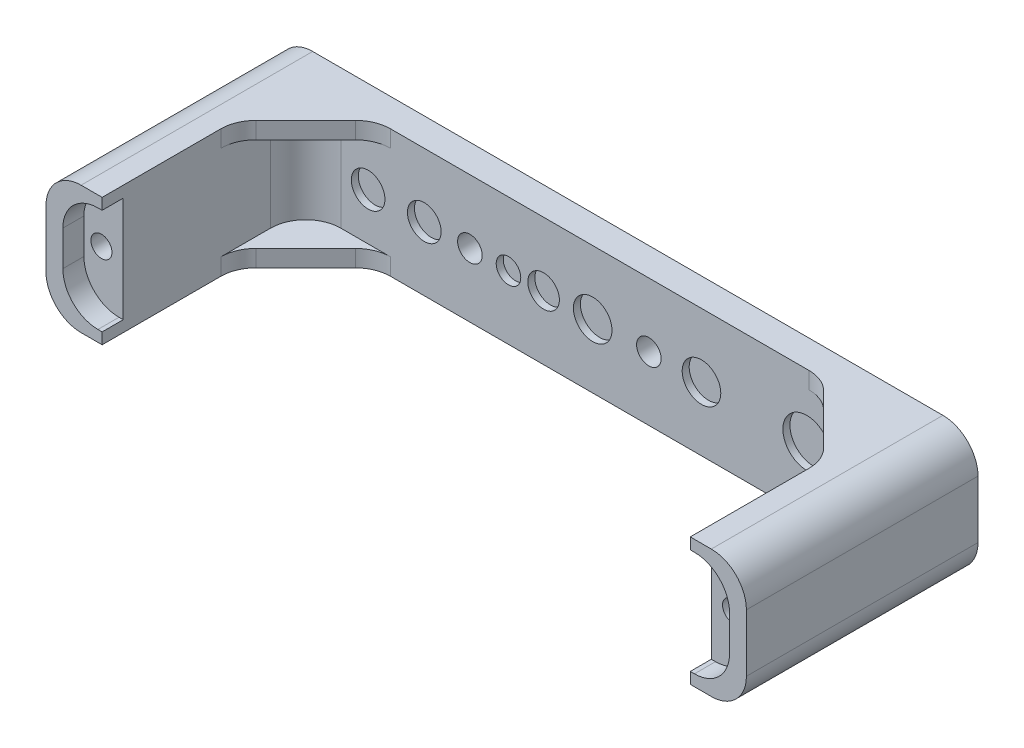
from build123d import *

# Parameters (mm, degrees)
SKETCH1_W                  = 99.8
SKETCH1_H                  = 18.2
BOSS_EXTRUDE1_DEPTH        = 30
SKETCH2_W                  = 99.8
SKETCH2_H                  = 18.2
BOSS_EXTRUDE2_DEPTH        = 3
SKETCH3_W                  = 83.8
SKETCH3_H                  = 39
CUT_EXTRUDE1_DEPTH         = 62.002049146
BOSS_EXTRUDE3_DEPTH        = 2.4
MIRROR2_COPY_1_DEPTH       = 2.4
SKETCH5_R                  = 2.4
SKETCH5_R_2                = 1.75
SKETCH5_R_3                = 2.25
SKETCH5_R_4                = 2.75
SKETCH5_R_5                = 3.4
CUT_EXTRUDE2_DEPTH         = 1
F_3_5_3_5_DIAMETER_HOLE1_D = 3.5
F_3_0_3_DIAMETER_HOLE1_D   = 3
FILLET1_R                  = 5
FILLET2_R                  = 5


with BuildPart() as part:
    # Sketch1 → Boss-Extrude1 (new body)
    with BuildSketch(Plane.XY):
        Rectangle(SKETCH1_W, SKETCH1_H)
    extrude(amount=-BOSS_EXTRUDE1_DEPTH)

    # Sketch2 → Boss-Extrude2 (add)
    with BuildSketch(Plane.XY):
        Rectangle(SKETCH2_W, SKETCH2_H)
        with BuildLine():
            ThreePointArc((-42.5, 7.5), (-46.035533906, 6.035533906), (-47.5, 2.5))
            Line((-47.5, 2.5), (-47.5, -2.5))
            ThreePointArc((-47.5, -2.5), (-46.035533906, -6.035533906), (-42.5, -7.5))
            Line((-42.5, -7.5), (42.5, -7.5))
            ThreePointArc((42.5, -7.5), (46.035533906, -6.035533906), (47.5, -2.5))
            Line((47.5, -2.5), (47.5, 2.5))
            ThreePointArc((47.5, 2.5), (46.035533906, 6.035533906), (42.5, 7.5))
            Line((42.5, 7.5), (-42.5, 7.5))
        make_face(mode=Mode.SUBTRACT)
    extrude(amount=BOSS_EXTRUDE2_DEPTH)

    # Sketch3 → Cut-Extrude1 (cut, through all)
    with BuildSketch(Plane.XZ.offset(9.1)):
        with Locations((0, -6.5)):
            Rectangle(SKETCH3_W, SKETCH3_H)
    extrude(amount=-CUT_EXTRUDE1_DEPTH, mode=Mode.SUBTRACT)

    # Sketch4 → Boss-Extrude3 (add)
    with BuildSketch(Plane.XZ.offset(9.1)):
        Polygon((-41.9, -16), (-41.9, -26), (-31.9, -26), align=None)
    boss_extrude3 = extrude(amount=-BOSS_EXTRUDE3_DEPTH)

    # Mirror1: Boss-Extrude3 across plane
    add(boss_extrude3.mirror(Plane.ZX))

    # Mirror2: Boss-Extrude3 across plane
    add(boss_extrude3.mirror(Plane(origin=(0, 0, 0), x_dir=(0, 0, 1), z_dir=(1, 0, 0))))

    # Mirror2 copy 1 sketch → Mirror2 copy 1 (add)
    with BuildSketch(Plane(origin=(0, 9.1, 0), x_dir=(-1, 0, 0), z_dir=(0, 1, 0))):
        Polygon((-41.9, -16), (-41.9, -26), (-31.9, -26), align=None)
    extrude(amount=-MIRROR2_COPY_1_DEPTH)

    # Sketch5 → Cut-Extrude2 (cut)
    with BuildSketch(Plane.XY.offset(-26)):
        with Locations((-33, 0)):
            Circle(SKETCH5_R)
        with Locations((-25, 0)):
            Circle(SKETCH5_R)
        with Locations((-13, 0)):
            Circle(SKETCH5_R_2)
        with Locations((-8, 0)):
            Circle(SKETCH5_R_3)
        with Locations((-1, 0)):
            Circle(SKETCH5_R_4)
        with Locations((14.5, 0)):
            Circle(SKETCH5_R_4)
        with Locations((29.5, 0)):
            Circle(SKETCH5_R_5)
    extrude(amount=-CUT_EXTRUDE2_DEPTH, mode=Mode.SUBTRACT)

    # 3.5 _3.5_ Diameter Hole1 (through all)
    with Locations(Plane.XY.offset(-26)):
        with Locations((-18.5, 0), (7, 0)):
            Hole(F_3_5_3_5_DIAMETER_HOLE1_D / 2)

    # 3.0 _3_ Diameter Hole1 (through all)
    with Locations(Plane.XY):
        with Locations((-45, 0), (45, 0)):
            Hole(F_3_0_3_DIAMETER_HOLE1_D / 2)

    # Fillet1
    fillet1_edges = [part.edges().sort_by_distance(p)[0] for p in [
        (49.9, -9.1, -13.5),
        (-49.9, -9.1, -13.5),
        (-49.9, 9.1, -13.5),
        (49.9, 9.1, -13.5),
    ]]
    fillet(fillet1_edges, radius=FILLET1_R)

    # Fillet2
    fillet2_edges = [part.edges().sort_by_distance(p)[0] for p in [
        (41.9, 0, -26),
        (41.9, 7.9, -16),
        (31.9, 7.9, -26),
        (31.9, -7.9, -26),
        (41.9, -7.9, -16),
        (-41.9, -7.9, -16),
        (-31.9, -7.9, -26),
        (-41.9, 0, -26),
        (-31.9, 7.9, -26),
        (-41.9, 7.9, -16),
    ]]
    fillet(fillet2_edges, radius=FILLET2_R)


solid = part.part
